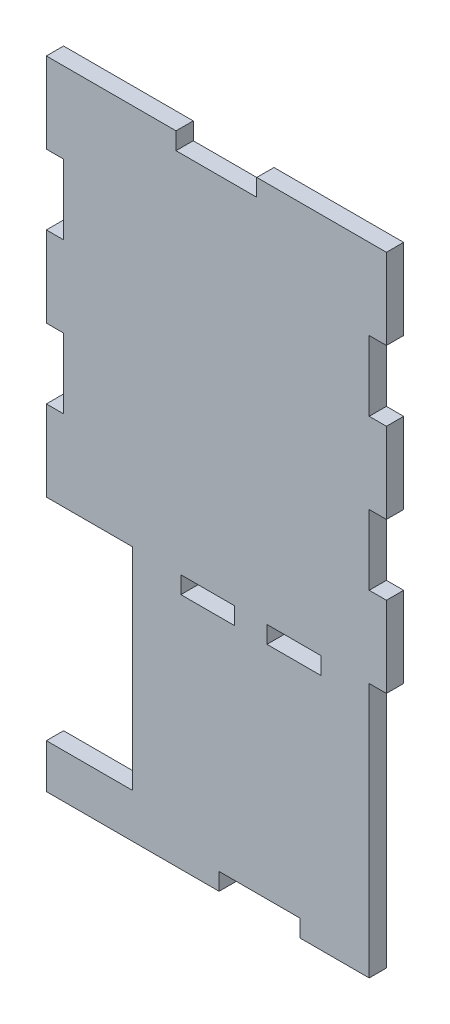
ISO-10303-21;
HEADER;
FILE_DESCRIPTION(('STEP AP214'),'2;1');
FILE_NAME('part.step','',(''),(''),'','','');
FILE_SCHEMA(('AUTOMOTIVE_DESIGN { 1 0 10303 214 1 1 1 1 }'));
ENDSEC;
DATA;
#1=APPLICATION_CONTEXT('core data for automotive mechanical design processes');
#2=APPLICATION_PROTOCOL_DEFINITION('international standard','automotive_design',2000,#1);
#3=PRODUCT_CONTEXT('',#1,'mechanical');
#4=PRODUCT('Part','Part','',(#3));
#5=PRODUCT_RELATED_PRODUCT_CATEGORY('part','',(#4));
#6=PRODUCT_DEFINITION_FORMATION('','',#4);
#7=PRODUCT_DEFINITION_CONTEXT('part definition',#1,'design');
#8=PRODUCT_DEFINITION('design','',#6,#7);
#9=PRODUCT_DEFINITION_SHAPE('','',#8);
#10=(LENGTH_UNIT() NAMED_UNIT(*) SI_UNIT(.MILLI.,.METRE.));
#11=(NAMED_UNIT(*) PLANE_ANGLE_UNIT() SI_UNIT($,.RADIAN.));
#12=(NAMED_UNIT(*) SI_UNIT($,.STERADIAN.) SOLID_ANGLE_UNIT());
#13=UNCERTAINTY_MEASURE_WITH_UNIT(LENGTH_MEASURE(1.E-05),#10,'distance_accuracy_value','');
#14=(GEOMETRIC_REPRESENTATION_CONTEXT(3) GLOBAL_UNCERTAINTY_ASSIGNED_CONTEXT((#13)) GLOBAL_UNIT_ASSIGNED_CONTEXT((#10,
#11,#12)) REPRESENTATION_CONTEXT('',''));
#15=CARTESIAN_POINT('',(0.,0.,0.));
#16=DIRECTION('',(0.,0.,1.));
#17=DIRECTION('',(1.,0.,0.));
#18=AXIS2_PLACEMENT_3D('',#15,#16,#17);
#19=CARTESIAN_POINT('',(0.,535.,16.));
#20=DIRECTION('',(0.,-1.,0.));
#21=DIRECTION('',(0.,0.,-1.));
#22=AXIS2_PLACEMENT_3D('',#19,#20,#21);
#23=PLANE('',#22);
#24=DIRECTION('',(-1.,0.,0.));
#25=VECTOR('',#24,1.);
#26=CARTESIAN_POINT('',(0.,535.,0.));
#27=LINE('',#26,#25);
#28=CARTESIAN_POINT('',(220.,535.,0.));
#29=VERTEX_POINT('',#28);
#30=CARTESIAN_POINT('',(99.5,535.,0.));
#31=VERTEX_POINT('',#30);
#32=EDGE_CURVE('E562',#29,#31,#27,.T.);
#33=ORIENTED_EDGE('',*,*,#32,.T.);
#34=DIRECTION('',(0.,0.,-1.));
#35=VECTOR('',#34,1.);
#36=CARTESIAN_POINT('',(99.5,535.,16.));
#37=LINE('',#36,#35);
#38=CARTESIAN_POINT('',(99.5,535.,16.));
#39=VERTEX_POINT('',#38);
#40=EDGE_CURVE('E12',#39,#31,#37,.T.);
#41=ORIENTED_EDGE('',*,*,#40,.F.);
#42=DIRECTION('',(-1.,0.,0.));
#43=VECTOR('',#42,1.);
#44=CARTESIAN_POINT('',(0.,535.,16.));
#45=LINE('',#44,#43);
#46=CARTESIAN_POINT('',(220.,535.,16.));
#47=VERTEX_POINT('',#46);
#48=EDGE_CURVE('E467',#47,#39,#45,.T.);
#49=ORIENTED_EDGE('',*,*,#48,.F.);
#50=DIRECTION('',(0.,0.,-1.));
#51=VECTOR('',#50,1.);
#52=CARTESIAN_POINT('',(220.,535.,16.));
#53=LINE('',#52,#51);
#54=EDGE_CURVE('E653',#47,#29,#53,.T.);
#55=ORIENTED_EDGE('',*,*,#54,.T.);
#56=EDGE_LOOP('',(#33,#41,#49,#55));
#57=FACE_BOUND('',#56,.T.);
#58=ADVANCED_FACE('F150',(#57),#23,.F.);
#59=CARTESIAN_POINT('',(99.5,0.,16.));
#60=DIRECTION('',(1.,0.,0.));
#61=DIRECTION('',(0.,0.,-1.));
#62=AXIS2_PLACEMENT_3D('',#59,#60,#61);
#63=PLANE('',#62);
#64=DIRECTION('',(0.,-1.,0.));
#65=VECTOR('',#64,1.);
#66=CARTESIAN_POINT('',(99.5,0.,0.));
#67=LINE('',#66,#65);
#68=CARTESIAN_POINT('',(99.5,519.,0.));
#69=VERTEX_POINT('',#68);
#70=EDGE_CURVE('E565',#31,#69,#67,.T.);
#71=ORIENTED_EDGE('',*,*,#70,.T.);
#72=DIRECTION('',(0.,0.,-1.));
#73=VECTOR('',#72,1.);
#74=CARTESIAN_POINT('',(99.5,519.,16.));
#75=LINE('',#74,#73);
#76=CARTESIAN_POINT('',(99.5,519.,16.));
#77=VERTEX_POINT('',#76);
#78=EDGE_CURVE('E159',#77,#69,#75,.T.);
#79=ORIENTED_EDGE('',*,*,#78,.F.);
#80=DIRECTION('',(0.,-1.,0.));
#81=VECTOR('',#80,1.);
#82=CARTESIAN_POINT('',(99.5,0.,16.));
#83=LINE('',#82,#81);
#84=EDGE_CURVE('E470',#39,#77,#83,.T.);
#85=ORIENTED_EDGE('',*,*,#84,.F.);
#86=ORIENTED_EDGE('',*,*,#40,.T.);
#87=EDGE_LOOP('',(#71,#79,#85,#86));
#88=FACE_BOUND('',#87,.T.);
#89=ADVANCED_FACE('F759',(#88),#63,.F.);
#90=CARTESIAN_POINT('',(0.,519.,16.));
#91=DIRECTION('',(0.,1.,0.));
#92=DIRECTION('',(0.,0.,1.));
#93=AXIS2_PLACEMENT_3D('',#90,#91,#92);
#94=PLANE('',#93);
#95=DIRECTION('',(1.,0.,0.));
#96=VECTOR('',#95,1.);
#97=CARTESIAN_POINT('',(0.,519.,0.));
#98=LINE('',#97,#96);
#99=CARTESIAN_POINT('',(24.5,519.,0.));
#100=VERTEX_POINT('',#99);
#101=EDGE_CURVE('E568',#100,#69,#98,.T.);
#102=ORIENTED_EDGE('',*,*,#101,.F.);
#103=DIRECTION('',(0.,0.,-1.));
#104=VECTOR('',#103,1.);
#105=CARTESIAN_POINT('',(24.5,519.,16.));
#106=LINE('',#105,#104);
#107=CARTESIAN_POINT('',(24.5,519.,16.));
#108=VERTEX_POINT('',#107);
#109=EDGE_CURVE('E723',#108,#100,#106,.T.);
#110=ORIENTED_EDGE('',*,*,#109,.F.);
#111=DIRECTION('',(1.,0.,0.));
#112=VECTOR('',#111,1.);
#113=CARTESIAN_POINT('',(0.,519.,16.));
#114=LINE('',#113,#112);
#115=EDGE_CURVE('E472',#108,#77,#114,.T.);
#116=ORIENTED_EDGE('',*,*,#115,.T.);
#117=ORIENTED_EDGE('',*,*,#78,.T.);
#118=EDGE_LOOP('',(#102,#110,#116,#117));
#119=FACE_BOUND('',#118,.T.);
#120=ADVANCED_FACE('F765',(#119),#94,.T.);
#121=CARTESIAN_POINT('',(24.5000000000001,0.,16.));
#122=DIRECTION('',(1.,0.,0.));
#123=DIRECTION('',(0.,1.,0.));
#124=AXIS2_PLACEMENT_3D('',#121,#122,#123);
#125=PLANE('',#124);
#126=DIRECTION('',(0.,-1.,0.));
#127=VECTOR('',#126,1.);
#128=CARTESIAN_POINT('',(24.5000000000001,0.,0.));
#129=LINE('',#128,#127);
#130=CARTESIAN_POINT('',(24.5,535.,0.));
#131=VERTEX_POINT('',#130);
#132=EDGE_CURVE('E571',#131,#100,#129,.T.);
#133=ORIENTED_EDGE('',*,*,#132,.F.);
#134=DIRECTION('',(0.,0.,-1.));
#135=VECTOR('',#134,1.);
#136=CARTESIAN_POINT('',(24.5,535.,16.));
#137=LINE('',#136,#135);
#138=CARTESIAN_POINT('',(24.5,535.,16.));
#139=VERTEX_POINT('',#138);
#140=EDGE_CURVE('E721',#139,#131,#137,.T.);
#141=ORIENTED_EDGE('',*,*,#140,.F.);
#142=DIRECTION('',(0.,-1.,0.));
#143=VECTOR('',#142,1.);
#144=CARTESIAN_POINT('',(24.5000000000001,0.,16.));
#145=LINE('',#144,#143);
#146=EDGE_CURVE('E475',#139,#108,#145,.T.);
#147=ORIENTED_EDGE('',*,*,#146,.T.);
#148=ORIENTED_EDGE('',*,*,#109,.T.);
#149=EDGE_LOOP('',(#133,#141,#147,#148));
#150=FACE_BOUND('',#149,.T.);
#151=ADVANCED_FACE('F771',(#150),#125,.T.);
#152=CARTESIAN_POINT('',(0.,535.,16.));
#153=DIRECTION('',(0.,-1.,0.));
#154=DIRECTION('',(0.,0.,-1.));
#155=AXIS2_PLACEMENT_3D('',#152,#153,#154);
#156=PLANE('',#155);
#157=DIRECTION('',(-1.,0.,0.));
#158=VECTOR('',#157,1.);
#159=CARTESIAN_POINT('',(0.,535.,0.));
#160=LINE('',#159,#158);
#161=CARTESIAN_POINT('',(-96.,535.,0.));
#162=VERTEX_POINT('',#161);
#163=EDGE_CURVE('E574',#131,#162,#160,.T.);
#164=ORIENTED_EDGE('',*,*,#163,.T.);
#165=DIRECTION('',(0.,0.,-1.));
#166=VECTOR('',#165,1.);
#167=CARTESIAN_POINT('',(-96.,535.,16.));
#168=LINE('',#167,#166);
#169=CARTESIAN_POINT('',(-96.,535.,16.));
#170=VERTEX_POINT('',#169);
#171=EDGE_CURVE('E719',#170,#162,#168,.T.);
#172=ORIENTED_EDGE('',*,*,#171,.F.);
#173=DIRECTION('',(-1.,0.,0.));
#174=VECTOR('',#173,1.);
#175=CARTESIAN_POINT('',(0.,535.,16.));
#176=LINE('',#175,#174);
#177=EDGE_CURVE('E478',#139,#170,#176,.T.);
#178=ORIENTED_EDGE('',*,*,#177,.F.);
#179=ORIENTED_EDGE('',*,*,#140,.T.);
#180=EDGE_LOOP('',(#164,#172,#178,#179));
#181=FACE_BOUND('',#180,.T.);
#182=ADVANCED_FACE('F775',(#181),#156,.F.);
#183=CARTESIAN_POINT('',(-96.,0.,16.));
#184=DIRECTION('',(-1.,0.,0.));
#185=DIRECTION('',(0.,0.,1.));
#186=AXIS2_PLACEMENT_3D('',#183,#184,#185);
#187=PLANE('',#186);
#188=DIRECTION('',(0.,1.,0.));
#189=VECTOR('',#188,1.);
#190=CARTESIAN_POINT('',(-96.,0.,0.));
#191=LINE('',#190,#189);
#192=CARTESIAN_POINT('',(-96.,460.,0.));
#193=VERTEX_POINT('',#192);
#194=EDGE_CURVE('E577',#193,#162,#191,.T.);
#195=ORIENTED_EDGE('',*,*,#194,.F.);
#196=DIRECTION('',(0.,0.,-1.));
#197=VECTOR('',#196,1.);
#198=CARTESIAN_POINT('',(-96.,460.,16.));
#199=LINE('',#198,#197);
#200=CARTESIAN_POINT('',(-96.,460.,16.));
#201=VERTEX_POINT('',#200);
#202=EDGE_CURVE('E717',#201,#193,#199,.T.);
#203=ORIENTED_EDGE('',*,*,#202,.F.);
#204=DIRECTION('',(0.,1.,0.));
#205=VECTOR('',#204,1.);
#206=CARTESIAN_POINT('',(-96.,0.,16.));
#207=LINE('',#206,#205);
#208=EDGE_CURVE('E480',#201,#170,#207,.T.);
#209=ORIENTED_EDGE('',*,*,#208,.T.);
#210=ORIENTED_EDGE('',*,*,#171,.T.);
#211=EDGE_LOOP('',(#195,#203,#209,#210));
#212=FACE_BOUND('',#211,.T.);
#213=ADVANCED_FACE('F779',(#212),#187,.T.);
#214=CARTESIAN_POINT('',(0.,460.,16.));
#215=DIRECTION('',(0.,1.,0.));
#216=DIRECTION('',(0.,0.,1.));
#217=AXIS2_PLACEMENT_3D('',#214,#215,#216);
#218=PLANE('',#217);
#219=DIRECTION('',(1.,0.,0.));
#220=VECTOR('',#219,1.);
#221=CARTESIAN_POINT('',(0.,460.,0.));
#222=LINE('',#221,#220);
#223=CARTESIAN_POINT('',(-80.,460.,0.));
#224=VERTEX_POINT('',#223);
#225=EDGE_CURVE('E580',#193,#224,#222,.T.);
#226=ORIENTED_EDGE('',*,*,#225,.T.);
#227=DIRECTION('',(0.,0.,-1.));
#228=VECTOR('',#227,1.);
#229=CARTESIAN_POINT('',(-80.,460.,16.));
#230=LINE('',#229,#228);
#231=CARTESIAN_POINT('',(-80.,460.,16.));
#232=VERTEX_POINT('',#231);
#233=EDGE_CURVE('E714',#232,#224,#230,.T.);
#234=ORIENTED_EDGE('',*,*,#233,.F.);
#235=DIRECTION('',(1.,0.,0.));
#236=VECTOR('',#235,1.);
#237=CARTESIAN_POINT('',(0.,460.,16.));
#238=LINE('',#237,#236);
#239=EDGE_CURVE('E483',#201,#232,#238,.T.);
#240=ORIENTED_EDGE('',*,*,#239,.F.);
#241=ORIENTED_EDGE('',*,*,#202,.T.);
#242=EDGE_LOOP('',(#226,#234,#240,#241));
#243=FACE_BOUND('',#242,.T.);
#244=ADVANCED_FACE('F783',(#243),#218,.F.);
#245=CARTESIAN_POINT('',(-80.,0.,16.));
#246=DIRECTION('',(1.,0.,0.));
#247=DIRECTION('',(0.,0.,-1.));
#248=AXIS2_PLACEMENT_3D('',#245,#246,#247);
#249=PLANE('',#248);
#250=DIRECTION('',(0.,-1.,0.));
#251=VECTOR('',#250,1.);
#252=CARTESIAN_POINT('',(-80.,0.,0.));
#253=LINE('',#252,#251);
#254=CARTESIAN_POINT('',(-80.,395.,0.));
#255=VERTEX_POINT('',#254);
#256=EDGE_CURVE('E582',#224,#255,#253,.T.);
#257=ORIENTED_EDGE('',*,*,#256,.T.);
#258=DIRECTION('',(0.,0.,-1.));
#259=VECTOR('',#258,1.);
#260=CARTESIAN_POINT('',(-80.,395.,16.));
#261=LINE('',#260,#259);
#262=CARTESIAN_POINT('',(-80.,395.,16.));
#263=VERTEX_POINT('',#262);
#264=EDGE_CURVE('E712',#263,#255,#261,.T.);
#265=ORIENTED_EDGE('',*,*,#264,.F.);
#266=DIRECTION('',(0.,-1.,0.));
#267=VECTOR('',#266,1.);
#268=CARTESIAN_POINT('',(-80.,0.,16.));
#269=LINE('',#268,#267);
#270=EDGE_CURVE('E485',#232,#263,#269,.T.);
#271=ORIENTED_EDGE('',*,*,#270,.F.);
#272=ORIENTED_EDGE('',*,*,#233,.T.);
#273=EDGE_LOOP('',(#257,#265,#271,#272));
#274=FACE_BOUND('',#273,.T.);
#275=ADVANCED_FACE('F787',(#274),#249,.F.);
#276=CARTESIAN_POINT('',(0.,395.,16.));
#277=DIRECTION('',(0.,1.,0.));
#278=DIRECTION('',(0.,0.,1.));
#279=AXIS2_PLACEMENT_3D('',#276,#277,#278);
#280=PLANE('',#279);
#281=DIRECTION('',(1.,0.,0.));
#282=VECTOR('',#281,1.);
#283=CARTESIAN_POINT('',(0.,395.,0.));
#284=LINE('',#283,#282);
#285=CARTESIAN_POINT('',(-96.,395.,0.));
#286=VERTEX_POINT('',#285);
#287=EDGE_CURVE('E585',#286,#255,#284,.T.);
#288=ORIENTED_EDGE('',*,*,#287,.F.);
#289=DIRECTION('',(0.,0.,-1.));
#290=VECTOR('',#289,1.);
#291=CARTESIAN_POINT('',(-96.,395.,16.));
#292=LINE('',#291,#290);
#293=CARTESIAN_POINT('',(-96.,395.,16.));
#294=VERTEX_POINT('',#293);
#295=EDGE_CURVE('E710',#294,#286,#292,.T.);
#296=ORIENTED_EDGE('',*,*,#295,.F.);
#297=DIRECTION('',(1.,0.,0.));
#298=VECTOR('',#297,1.);
#299=CARTESIAN_POINT('',(0.,395.,16.));
#300=LINE('',#299,#298);
#301=EDGE_CURVE('E487',#294,#263,#300,.T.);
#302=ORIENTED_EDGE('',*,*,#301,.T.);
#303=ORIENTED_EDGE('',*,*,#264,.T.);
#304=EDGE_LOOP('',(#288,#296,#302,#303));
#305=FACE_BOUND('',#304,.T.);
#306=ADVANCED_FACE('F791',(#305),#280,.T.);
#307=CARTESIAN_POINT('',(-96.,0.,16.));
#308=DIRECTION('',(-1.,0.,0.));
#309=DIRECTION('',(0.,0.,1.));
#310=AXIS2_PLACEMENT_3D('',#307,#308,#309);
#311=PLANE('',#310);
#312=DIRECTION('',(0.,1.,0.));
#313=VECTOR('',#312,1.);
#314=CARTESIAN_POINT('',(-96.,0.,0.));
#315=LINE('',#314,#313);
#316=CARTESIAN_POINT('',(-96.,320.,0.));
#317=VERTEX_POINT('',#316);
#318=EDGE_CURVE('E588',#317,#286,#315,.T.);
#319=ORIENTED_EDGE('',*,*,#318,.F.);
#320=DIRECTION('',(0.,0.,-1.));
#321=VECTOR('',#320,1.);
#322=CARTESIAN_POINT('',(-96.,320.,16.));
#323=LINE('',#322,#321);
#324=CARTESIAN_POINT('',(-96.,320.,16.));
#325=VERTEX_POINT('',#324);
#326=EDGE_CURVE('E708',#325,#317,#323,.T.);
#327=ORIENTED_EDGE('',*,*,#326,.F.);
#328=DIRECTION('',(0.,1.,0.));
#329=VECTOR('',#328,1.);
#330=CARTESIAN_POINT('',(-96.,0.,16.));
#331=LINE('',#330,#329);
#332=EDGE_CURVE('E490',#325,#294,#331,.T.);
#333=ORIENTED_EDGE('',*,*,#332,.T.);
#334=ORIENTED_EDGE('',*,*,#295,.T.);
#335=EDGE_LOOP('',(#319,#327,#333,#334));
#336=FACE_BOUND('',#335,.T.);
#337=ADVANCED_FACE('F795',(#336),#311,.T.);
#338=CARTESIAN_POINT('',(0.,320.,16.));
#339=DIRECTION('',(0.,1.,0.));
#340=DIRECTION('',(0.,0.,1.));
#341=AXIS2_PLACEMENT_3D('',#338,#339,#340);
#342=PLANE('',#341);
#343=DIRECTION('',(1.,0.,0.));
#344=VECTOR('',#343,1.);
#345=CARTESIAN_POINT('',(0.,320.,0.));
#346=LINE('',#345,#344);
#347=CARTESIAN_POINT('',(-80.,320.,0.));
#348=VERTEX_POINT('',#347);
#349=EDGE_CURVE('E591',#317,#348,#346,.T.);
#350=ORIENTED_EDGE('',*,*,#349,.T.);
#351=DIRECTION('',(0.,0.,-1.));
#352=VECTOR('',#351,1.);
#353=CARTESIAN_POINT('',(-80.,320.,16.));
#354=LINE('',#353,#352);
#355=CARTESIAN_POINT('',(-80.,320.,16.));
#356=VERTEX_POINT('',#355);
#357=EDGE_CURVE('E705',#356,#348,#354,.T.);
#358=ORIENTED_EDGE('',*,*,#357,.F.);
#359=DIRECTION('',(1.,0.,0.));
#360=VECTOR('',#359,1.);
#361=CARTESIAN_POINT('',(0.,320.,16.));
#362=LINE('',#361,#360);
#363=EDGE_CURVE('E493',#325,#356,#362,.T.);
#364=ORIENTED_EDGE('',*,*,#363,.F.);
#365=ORIENTED_EDGE('',*,*,#326,.T.);
#366=EDGE_LOOP('',(#350,#358,#364,#365));
#367=FACE_BOUND('',#366,.T.);
#368=ADVANCED_FACE('F799',(#367),#342,.F.);
#369=CARTESIAN_POINT('',(-80.0000000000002,0.,16.));
#370=DIRECTION('',(1.,0.,0.));
#371=DIRECTION('',(0.,1.,0.));
#372=AXIS2_PLACEMENT_3D('',#369,#370,#371);
#373=PLANE('',#372);
#374=DIRECTION('',(0.,-1.,0.));
#375=VECTOR('',#374,1.);
#376=CARTESIAN_POINT('',(-80.0000000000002,0.,0.));
#377=LINE('',#376,#375);
#378=CARTESIAN_POINT('',(-80.,255.,0.));
#379=VERTEX_POINT('',#378);
#380=EDGE_CURVE('E593',#348,#379,#377,.T.);
#381=ORIENTED_EDGE('',*,*,#380,.T.);
#382=DIRECTION('',(0.,0.,-1.));
#383=VECTOR('',#382,1.);
#384=CARTESIAN_POINT('',(-80.,255.,16.));
#385=LINE('',#384,#383);
#386=CARTESIAN_POINT('',(-80.,255.,16.));
#387=VERTEX_POINT('',#386);
#388=EDGE_CURVE('E703',#387,#379,#385,.T.);
#389=ORIENTED_EDGE('',*,*,#388,.F.);
#390=DIRECTION('',(0.,-1.,0.));
#391=VECTOR('',#390,1.);
#392=CARTESIAN_POINT('',(-80.0000000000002,0.,16.));
#393=LINE('',#392,#391);
#394=EDGE_CURVE('E495',#356,#387,#393,.T.);
#395=ORIENTED_EDGE('',*,*,#394,.F.);
#396=ORIENTED_EDGE('',*,*,#357,.T.);
#397=EDGE_LOOP('',(#381,#389,#395,#396));
#398=FACE_BOUND('',#397,.T.);
#399=ADVANCED_FACE('F803',(#398),#373,.F.);
#400=CARTESIAN_POINT('',(0.,255.,16.));
#401=DIRECTION('',(0.,1.,0.));
#402=DIRECTION('',(0.,0.,1.));
#403=AXIS2_PLACEMENT_3D('',#400,#401,#402);
#404=PLANE('',#403);
#405=DIRECTION('',(1.,0.,0.));
#406=VECTOR('',#405,1.);
#407=CARTESIAN_POINT('',(0.,255.,0.));
#408=LINE('',#407,#406);
#409=CARTESIAN_POINT('',(-96.,255.,0.));
#410=VERTEX_POINT('',#409);
#411=EDGE_CURVE('E596',#410,#379,#408,.T.);
#412=ORIENTED_EDGE('',*,*,#411,.F.);
#413=DIRECTION('',(0.,0.,-1.));
#414=VECTOR('',#413,1.);
#415=CARTESIAN_POINT('',(-96.,255.,16.));
#416=LINE('',#415,#414);
#417=CARTESIAN_POINT('',(-96.,255.,16.));
#418=VERTEX_POINT('',#417);
#419=EDGE_CURVE('E701',#418,#410,#416,.T.);
#420=ORIENTED_EDGE('',*,*,#419,.F.);
#421=DIRECTION('',(1.,0.,0.));
#422=VECTOR('',#421,1.);
#423=CARTESIAN_POINT('',(0.,255.,16.));
#424=LINE('',#423,#422);
#425=EDGE_CURVE('E497',#418,#387,#424,.T.);
#426=ORIENTED_EDGE('',*,*,#425,.T.);
#427=ORIENTED_EDGE('',*,*,#388,.T.);
#428=EDGE_LOOP('',(#412,#420,#426,#427));
#429=FACE_BOUND('',#428,.T.);
#430=ADVANCED_FACE('F807',(#429),#404,.T.);
#431=CARTESIAN_POINT('',(-96.,0.,16.));
#432=DIRECTION('',(-1.,0.,0.));
#433=DIRECTION('',(0.,0.,1.));
#434=AXIS2_PLACEMENT_3D('',#431,#432,#433);
#435=PLANE('',#434);
#436=DIRECTION('',(0.,1.,0.));
#437=VECTOR('',#436,1.);
#438=CARTESIAN_POINT('',(-96.,0.,0.));
#439=LINE('',#438,#437);
#440=CARTESIAN_POINT('',(-96.,180.,0.));
#441=VERTEX_POINT('',#440);
#442=EDGE_CURVE('E599',#441,#410,#439,.T.);
#443=ORIENTED_EDGE('',*,*,#442,.F.);
#444=DIRECTION('',(0.,0.,-1.));
#445=VECTOR('',#444,1.);
#446=CARTESIAN_POINT('',(-96.,180.,16.));
#447=LINE('',#446,#445);
#448=CARTESIAN_POINT('',(-96.,180.,16.));
#449=VERTEX_POINT('',#448);
#450=EDGE_CURVE('E699',#449,#441,#447,.T.);
#451=ORIENTED_EDGE('',*,*,#450,.F.);
#452=DIRECTION('',(0.,1.,0.));
#453=VECTOR('',#452,1.);
#454=CARTESIAN_POINT('',(-96.,0.,16.));
#455=LINE('',#454,#453);
#456=EDGE_CURVE('E500',#449,#418,#455,.T.);
#457=ORIENTED_EDGE('',*,*,#456,.T.);
#458=ORIENTED_EDGE('',*,*,#419,.T.);
#459=EDGE_LOOP('',(#443,#451,#457,#458));
#460=FACE_BOUND('',#459,.T.);
#461=ADVANCED_FACE('F811',(#460),#435,.T.);
#462=CARTESIAN_POINT('',(0.,180.,16.));
#463=DIRECTION('',(0.,1.,0.));
#464=DIRECTION('',(0.,0.,1.));
#465=AXIS2_PLACEMENT_3D('',#462,#463,#464);
#466=PLANE('',#465);
#467=DIRECTION('',(1.,0.,0.));
#468=VECTOR('',#467,1.);
#469=CARTESIAN_POINT('',(0.,180.,0.));
#470=LINE('',#469,#468);
#471=CARTESIAN_POINT('',(-15.9999999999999,180.,0.));
#472=VERTEX_POINT('',#471);
#473=EDGE_CURVE('E602',#441,#472,#470,.T.);
#474=ORIENTED_EDGE('',*,*,#473,.T.);
#475=DIRECTION('',(0.,0.,-1.));
#476=VECTOR('',#475,1.);
#477=CARTESIAN_POINT('',(-15.9999999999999,180.,16.));
#478=LINE('',#477,#476);
#479=CARTESIAN_POINT('',(-15.9999999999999,180.,16.));
#480=VERTEX_POINT('',#479);
#481=EDGE_CURVE('E696',#480,#472,#478,.T.);
#482=ORIENTED_EDGE('',*,*,#481,.F.);
#483=DIRECTION('',(1.,0.,0.));
#484=VECTOR('',#483,1.);
#485=CARTESIAN_POINT('',(0.,180.,16.));
#486=LINE('',#485,#484);
#487=EDGE_CURVE('E503',#449,#480,#486,.T.);
#488=ORIENTED_EDGE('',*,*,#487,.F.);
#489=ORIENTED_EDGE('',*,*,#450,.T.);
#490=EDGE_LOOP('',(#474,#482,#488,#489));
#491=FACE_BOUND('',#490,.T.);
#492=ADVANCED_FACE('F815',(#491),#466,.F.);
#493=CARTESIAN_POINT('',(-16.,0.,16.));
#494=DIRECTION('',(1.,0.,0.));
#495=DIRECTION('',(0.,1.,0.));
#496=AXIS2_PLACEMENT_3D('',#493,#494,#495);
#497=PLANE('',#496);
#498=DIRECTION('',(0.,-1.,0.));
#499=VECTOR('',#498,1.);
#500=CARTESIAN_POINT('',(-16.,0.,0.));
#501=LINE('',#500,#499);
#502=CARTESIAN_POINT('',(-16.,-16.,0.));
#503=VERTEX_POINT('',#502);
#504=EDGE_CURVE('E604',#472,#503,#501,.T.);
#505=ORIENTED_EDGE('',*,*,#504,.T.);
#506=DIRECTION('',(0.,0.,-1.));
#507=VECTOR('',#506,1.);
#508=CARTESIAN_POINT('',(-16.,-16.,16.));
#509=LINE('',#508,#507);
#510=CARTESIAN_POINT('',(-16.,-16.,16.));
#511=VERTEX_POINT('',#510);
#512=EDGE_CURVE('E694',#511,#503,#509,.T.);
#513=ORIENTED_EDGE('',*,*,#512,.F.);
#514=DIRECTION('',(0.,-1.,0.));
#515=VECTOR('',#514,1.);
#516=CARTESIAN_POINT('',(-16.,0.,16.));
#517=LINE('',#516,#515);
#518=EDGE_CURVE('E505',#480,#511,#517,.T.);
#519=ORIENTED_EDGE('',*,*,#518,.F.);
#520=ORIENTED_EDGE('',*,*,#481,.T.);
#521=EDGE_LOOP('',(#505,#513,#519,#520));
#522=FACE_BOUND('',#521,.T.);
#523=ADVANCED_FACE('F819',(#522),#497,.F.);
#524=CARTESIAN_POINT('',(0.,-16.,16.));
#525=DIRECTION('',(0.,1.,0.));
#526=DIRECTION('',(-1.,0.,0.));
#527=AXIS2_PLACEMENT_3D('',#524,#525,#526);
#528=PLANE('',#527);
#529=DIRECTION('',(1.,0.,0.));
#530=VECTOR('',#529,1.);
#531=CARTESIAN_POINT('',(0.,-16.,0.));
#532=LINE('',#531,#530);
#533=CARTESIAN_POINT('',(-96.,-16.,0.));
#534=VERTEX_POINT('',#533);
#535=EDGE_CURVE('E607',#534,#503,#532,.T.);
#536=ORIENTED_EDGE('',*,*,#535,.F.);
#537=DIRECTION('',(0.,0.,-1.));
#538=VECTOR('',#537,1.);
#539=CARTESIAN_POINT('',(-96.,-16.,16.));
#540=LINE('',#539,#538);
#541=CARTESIAN_POINT('',(-96.,-16.,16.));
#542=VERTEX_POINT('',#541);
#543=EDGE_CURVE('E692',#542,#534,#540,.T.);
#544=ORIENTED_EDGE('',*,*,#543,.F.);
#545=DIRECTION('',(1.,0.,0.));
#546=VECTOR('',#545,1.);
#547=CARTESIAN_POINT('',(0.,-16.,16.));
#548=LINE('',#547,#546);
#549=EDGE_CURVE('E507',#542,#511,#548,.T.);
#550=ORIENTED_EDGE('',*,*,#549,.T.);
#551=ORIENTED_EDGE('',*,*,#512,.T.);
#552=EDGE_LOOP('',(#536,#544,#550,#551));
#553=FACE_BOUND('',#552,.T.);
#554=ADVANCED_FACE('F823',(#553),#528,.T.);
#555=CARTESIAN_POINT('',(-96.,0.,16.));
#556=DIRECTION('',(-1.,0.,0.));
#557=DIRECTION('',(0.,0.,1.));
#558=AXIS2_PLACEMENT_3D('',#555,#556,#557);
#559=PLANE('',#558);
#560=DIRECTION('',(0.,1.,0.));
#561=VECTOR('',#560,1.);
#562=CARTESIAN_POINT('',(-96.,0.,0.));
#563=LINE('',#562,#561);
#564=CARTESIAN_POINT('',(-96.,-57.,0.));
#565=VERTEX_POINT('',#564);
#566=EDGE_CURVE('E610',#565,#534,#563,.T.);
#567=ORIENTED_EDGE('',*,*,#566,.F.);
#568=DIRECTION('',(0.,0.,-1.));
#569=VECTOR('',#568,1.);
#570=CARTESIAN_POINT('',(-96.,-57.,16.));
#571=LINE('',#570,#569);
#572=CARTESIAN_POINT('',(-96.,-57.,16.));
#573=VERTEX_POINT('',#572);
#574=EDGE_CURVE('E690',#573,#565,#571,.T.);
#575=ORIENTED_EDGE('',*,*,#574,.F.);
#576=DIRECTION('',(0.,1.,0.));
#577=VECTOR('',#576,1.);
#578=CARTESIAN_POINT('',(-96.,0.,16.));
#579=LINE('',#578,#577);
#580=EDGE_CURVE('E510',#573,#542,#579,.T.);
#581=ORIENTED_EDGE('',*,*,#580,.T.);
#582=ORIENTED_EDGE('',*,*,#543,.T.);
#583=EDGE_LOOP('',(#567,#575,#581,#582));
#584=FACE_BOUND('',#583,.T.);
#585=ADVANCED_FACE('F827',(#584),#559,.T.);
#586=CARTESIAN_POINT('',(0.,-57.,16.));
#587=DIRECTION('',(0.,1.,0.));
#588=DIRECTION('',(0.,0.,1.));
#589=AXIS2_PLACEMENT_3D('',#586,#587,#588);
#590=PLANE('',#589);
#591=DIRECTION('',(1.,0.,0.));
#592=VECTOR('',#591,1.);
#593=CARTESIAN_POINT('',(0.,-57.,0.));
#594=LINE('',#593,#592);
#595=CARTESIAN_POINT('',(64.5,-57.,0.));
#596=VERTEX_POINT('',#595);
#597=EDGE_CURVE('E613',#565,#596,#594,.T.);
#598=ORIENTED_EDGE('',*,*,#597,.T.);
#599=DIRECTION('',(0.,0.,-1.));
#600=VECTOR('',#599,1.);
#601=CARTESIAN_POINT('',(64.5,-57.,16.));
#602=LINE('',#601,#600);
#603=CARTESIAN_POINT('',(64.5,-57.,16.));
#604=VERTEX_POINT('',#603);
#605=EDGE_CURVE('E687',#604,#596,#602,.T.);
#606=ORIENTED_EDGE('',*,*,#605,.F.);
#607=DIRECTION('',(1.,0.,0.));
#608=VECTOR('',#607,1.);
#609=CARTESIAN_POINT('',(0.,-57.,16.));
#610=LINE('',#609,#608);
#611=EDGE_CURVE('E513',#573,#604,#610,.T.);
#612=ORIENTED_EDGE('',*,*,#611,.F.);
#613=ORIENTED_EDGE('',*,*,#574,.T.);
#614=EDGE_LOOP('',(#598,#606,#612,#613));
#615=FACE_BOUND('',#614,.T.);
#616=ADVANCED_FACE('F831',(#615),#590,.F.);
#617=CARTESIAN_POINT('',(64.5,0.,16.));
#618=DIRECTION('',(-1.,0.,0.));
#619=DIRECTION('',(0.,0.,1.));
#620=AXIS2_PLACEMENT_3D('',#617,#618,#619);
#621=PLANE('',#620);
#622=DIRECTION('',(0.,1.,0.));
#623=VECTOR('',#622,1.);
#624=CARTESIAN_POINT('',(64.5,0.,0.));
#625=LINE('',#624,#623);
#626=CARTESIAN_POINT('',(64.5,-41.,0.));
#627=VERTEX_POINT('',#626);
#628=EDGE_CURVE('E615',#596,#627,#625,.T.);
#629=ORIENTED_EDGE('',*,*,#628,.T.);
#630=DIRECTION('',(0.,0.,-1.));
#631=VECTOR('',#630,1.);
#632=CARTESIAN_POINT('',(64.5,-41.,16.));
#633=LINE('',#632,#631);
#634=CARTESIAN_POINT('',(64.5,-41.,16.));
#635=VERTEX_POINT('',#634);
#636=EDGE_CURVE('E684',#635,#627,#633,.T.);
#637=ORIENTED_EDGE('',*,*,#636,.F.);
#638=DIRECTION('',(0.,1.,0.));
#639=VECTOR('',#638,1.);
#640=CARTESIAN_POINT('',(64.5,0.,16.));
#641=LINE('',#640,#639);
#642=EDGE_CURVE('E515',#604,#635,#641,.T.);
#643=ORIENTED_EDGE('',*,*,#642,.F.);
#644=ORIENTED_EDGE('',*,*,#605,.T.);
#645=EDGE_LOOP('',(#629,#637,#643,#644));
#646=FACE_BOUND('',#645,.T.);
#647=ADVANCED_FACE('F833',(#646),#621,.F.);
#648=CARTESIAN_POINT('',(0.,-41.,16.));
#649=DIRECTION('',(0.,1.,0.));
#650=DIRECTION('',(0.,0.,1.));
#651=AXIS2_PLACEMENT_3D('',#648,#649,#650);
#652=PLANE('',#651);
#653=DIRECTION('',(1.,0.,0.));
#654=VECTOR('',#653,1.);
#655=CARTESIAN_POINT('',(0.,-41.,0.));
#656=LINE('',#655,#654);
#657=CARTESIAN_POINT('',(139.5,-41.,0.));
#658=VERTEX_POINT('',#657);
#659=EDGE_CURVE('E618',#627,#658,#656,.T.);
#660=ORIENTED_EDGE('',*,*,#659,.T.);
#661=DIRECTION('',(0.,0.,-1.));
#662=VECTOR('',#661,1.);
#663=CARTESIAN_POINT('',(139.5,-41.,16.));
#664=LINE('',#663,#662);
#665=CARTESIAN_POINT('',(139.5,-41.,16.));
#666=VERTEX_POINT('',#665);
#667=EDGE_CURVE('E682',#666,#658,#664,.T.);
#668=ORIENTED_EDGE('',*,*,#667,.F.);
#669=DIRECTION('',(1.,0.,0.));
#670=VECTOR('',#669,1.);
#671=CARTESIAN_POINT('',(0.,-41.,16.));
#672=LINE('',#671,#670);
#673=EDGE_CURVE('E518',#635,#666,#672,.T.);
#674=ORIENTED_EDGE('',*,*,#673,.F.);
#675=ORIENTED_EDGE('',*,*,#636,.T.);
#676=EDGE_LOOP('',(#660,#668,#674,#675));
#677=FACE_BOUND('',#676,.T.);
#678=ADVANCED_FACE('F836',(#677),#652,.F.);
#679=CARTESIAN_POINT('',(139.5,0.,16.));
#680=DIRECTION('',(-1.,0.,0.));
#681=DIRECTION('',(0.,0.,1.));
#682=AXIS2_PLACEMENT_3D('',#679,#680,#681);
#683=PLANE('',#682);
#684=DIRECTION('',(0.,1.,0.));
#685=VECTOR('',#684,1.);
#686=CARTESIAN_POINT('',(139.5,0.,0.));
#687=LINE('',#686,#685);
#688=CARTESIAN_POINT('',(139.5,-57.,0.));
#689=VERTEX_POINT('',#688);
#690=EDGE_CURVE('E621',#689,#658,#687,.T.);
#691=ORIENTED_EDGE('',*,*,#690,.F.);
#692=DIRECTION('',(0.,0.,-1.));
#693=VECTOR('',#692,1.);
#694=CARTESIAN_POINT('',(139.5,-57.,16.));
#695=LINE('',#694,#693);
#696=CARTESIAN_POINT('',(139.5,-57.,16.));
#697=VERTEX_POINT('',#696);
#698=EDGE_CURVE('E680',#697,#689,#695,.T.);
#699=ORIENTED_EDGE('',*,*,#698,.F.);
#700=DIRECTION('',(0.,1.,0.));
#701=VECTOR('',#700,1.);
#702=CARTESIAN_POINT('',(139.5,0.,16.));
#703=LINE('',#702,#701);
#704=EDGE_CURVE('E520',#697,#666,#703,.T.);
#705=ORIENTED_EDGE('',*,*,#704,.T.);
#706=ORIENTED_EDGE('',*,*,#667,.T.);
#707=EDGE_LOOP('',(#691,#699,#705,#706));
#708=FACE_BOUND('',#707,.T.);
#709=ADVANCED_FACE('F840',(#708),#683,.T.);
#710=CARTESIAN_POINT('',(204.,-57.,0.));
#711=VERTEX_POINT('',#710);
#712=EDGE_CURVE('E616',#689,#711,#594,.T.);
#713=ORIENTED_EDGE('',*,*,#712,.T.);
#714=DIRECTION('',(0.,0.,-1.));
#715=VECTOR('',#714,1.);
#716=CARTESIAN_POINT('',(204.,-57.,16.));
#717=LINE('',#716,#715);
#718=CARTESIAN_POINT('',(204.,-57.,16.));
#719=VERTEX_POINT('',#718);
#720=EDGE_CURVE('E678',#719,#711,#717,.T.);
#721=ORIENTED_EDGE('',*,*,#720,.F.);
#722=EDGE_CURVE('E516',#697,#719,#610,.T.);
#723=ORIENTED_EDGE('',*,*,#722,.F.);
#724=ORIENTED_EDGE('',*,*,#698,.T.);
#725=EDGE_LOOP('',(#713,#721,#723,#724));
#726=FACE_BOUND('',#725,.T.);
#727=ADVANCED_FACE('F844',(#726),#590,.F.);
#728=CARTESIAN_POINT('',(204.,0.,16.));
#729=DIRECTION('',(1.,0.,0.));
#730=DIRECTION('',(0.,0.,-1.));
#731=AXIS2_PLACEMENT_3D('',#728,#729,#730);
#732=PLANE('',#731);
#733=DIRECTION('',(0.,-1.,0.));
#734=VECTOR('',#733,1.);
#735=CARTESIAN_POINT('',(204.,0.,0.));
#736=LINE('',#735,#734);
#737=CARTESIAN_POINT('',(204.,180.,0.));
#738=VERTEX_POINT('',#737);
#739=EDGE_CURVE('E624',#738,#711,#736,.T.);
#740=ORIENTED_EDGE('',*,*,#739,.F.);
#741=DIRECTION('',(0.,0.,-1.));
#742=VECTOR('',#741,1.);
#743=CARTESIAN_POINT('',(204.,180.,16.));
#744=LINE('',#743,#742);
#745=CARTESIAN_POINT('',(204.,180.,16.));
#746=VERTEX_POINT('',#745);
#747=EDGE_CURVE('E676',#746,#738,#744,.T.);
#748=ORIENTED_EDGE('',*,*,#747,.F.);
#749=DIRECTION('',(0.,-1.,0.));
#750=VECTOR('',#749,1.);
#751=CARTESIAN_POINT('',(204.,0.,16.));
#752=LINE('',#751,#750);
#753=EDGE_CURVE('E523',#746,#719,#752,.T.);
#754=ORIENTED_EDGE('',*,*,#753,.T.);
#755=ORIENTED_EDGE('',*,*,#720,.T.);
#756=EDGE_LOOP('',(#740,#748,#754,#755));
#757=FACE_BOUND('',#756,.T.);
#758=ADVANCED_FACE('F848',(#757),#732,.T.);
#759=CARTESIAN_POINT('',(0.,180.,16.));
#760=DIRECTION('',(0.,-1.,0.));
#761=DIRECTION('',(0.,0.,-1.));
#762=AXIS2_PLACEMENT_3D('',#759,#760,#761);
#763=PLANE('',#762);
#764=DIRECTION('',(-1.,0.,0.));
#765=VECTOR('',#764,1.);
#766=CARTESIAN_POINT('',(0.,180.,0.));
#767=LINE('',#766,#765);
#768=CARTESIAN_POINT('',(220.,180.,0.));
#769=VERTEX_POINT('',#768);
#770=EDGE_CURVE('E627',#769,#738,#767,.T.);
#771=ORIENTED_EDGE('',*,*,#770,.F.);
#772=DIRECTION('',(0.,0.,-1.));
#773=VECTOR('',#772,1.);
#774=CARTESIAN_POINT('',(220.,180.,16.));
#775=LINE('',#774,#773);
#776=CARTESIAN_POINT('',(220.,180.,16.));
#777=VERTEX_POINT('',#776);
#778=EDGE_CURVE('E674',#777,#769,#775,.T.);
#779=ORIENTED_EDGE('',*,*,#778,.F.);
#780=DIRECTION('',(-1.,0.,0.));
#781=VECTOR('',#780,1.);
#782=CARTESIAN_POINT('',(0.,180.,16.));
#783=LINE('',#782,#781);
#784=EDGE_CURVE('E526',#777,#746,#783,.T.);
#785=ORIENTED_EDGE('',*,*,#784,.T.);
#786=ORIENTED_EDGE('',*,*,#747,.T.);
#787=EDGE_LOOP('',(#771,#779,#785,#786));
#788=FACE_BOUND('',#787,.T.);
#789=ADVANCED_FACE('F852',(#788),#763,.T.);
#790=CARTESIAN_POINT('',(220.,0.,16.));
#791=DIRECTION('',(-1.,0.,0.));
#792=DIRECTION('',(0.,0.,1.));
#793=AXIS2_PLACEMENT_3D('',#790,#791,#792);
#794=PLANE('',#793);
#795=DIRECTION('',(0.,1.,0.));
#796=VECTOR('',#795,1.);
#797=CARTESIAN_POINT('',(220.,0.,0.));
#798=LINE('',#797,#796);
#799=CARTESIAN_POINT('',(220.,255.,0.));
#800=VERTEX_POINT('',#799);
#801=EDGE_CURVE('E630',#769,#800,#798,.T.);
#802=ORIENTED_EDGE('',*,*,#801,.T.);
#803=DIRECTION('',(0.,0.,-1.));
#804=VECTOR('',#803,1.);
#805=CARTESIAN_POINT('',(220.,255.,16.));
#806=LINE('',#805,#804);
#807=CARTESIAN_POINT('',(220.,255.,16.));
#808=VERTEX_POINT('',#807);
#809=EDGE_CURVE('E671',#808,#800,#806,.T.);
#810=ORIENTED_EDGE('',*,*,#809,.F.);
#811=DIRECTION('',(0.,1.,0.));
#812=VECTOR('',#811,1.);
#813=CARTESIAN_POINT('',(220.,0.,16.));
#814=LINE('',#813,#812);
#815=EDGE_CURVE('E529',#777,#808,#814,.T.);
#816=ORIENTED_EDGE('',*,*,#815,.F.);
#817=ORIENTED_EDGE('',*,*,#778,.T.);
#818=EDGE_LOOP('',(#802,#810,#816,#817));
#819=FACE_BOUND('',#818,.T.);
#820=ADVANCED_FACE('F856',(#819),#794,.F.);
#821=CARTESIAN_POINT('',(0.,255.,16.));
#822=DIRECTION('',(0.,-1.,0.));
#823=DIRECTION('',(0.,0.,-1.));
#824=AXIS2_PLACEMENT_3D('',#821,#822,#823);
#825=PLANE('',#824);
#826=DIRECTION('',(-1.,0.,0.));
#827=VECTOR('',#826,1.);
#828=CARTESIAN_POINT('',(0.,255.,0.));
#829=LINE('',#828,#827);
#830=CARTESIAN_POINT('',(204.,255.,0.));
#831=VERTEX_POINT('',#830);
#832=EDGE_CURVE('E632',#800,#831,#829,.T.);
#833=ORIENTED_EDGE('',*,*,#832,.T.);
#834=DIRECTION('',(0.,0.,-1.));
#835=VECTOR('',#834,1.);
#836=CARTESIAN_POINT('',(204.,255.,16.));
#837=LINE('',#836,#835);
#838=CARTESIAN_POINT('',(204.,255.,16.));
#839=VERTEX_POINT('',#838);
#840=EDGE_CURVE('E669',#839,#831,#837,.T.);
#841=ORIENTED_EDGE('',*,*,#840,.F.);
#842=DIRECTION('',(-1.,0.,0.));
#843=VECTOR('',#842,1.);
#844=CARTESIAN_POINT('',(0.,255.,16.));
#845=LINE('',#844,#843);
#846=EDGE_CURVE('E531',#808,#839,#845,.T.);
#847=ORIENTED_EDGE('',*,*,#846,.F.);
#848=ORIENTED_EDGE('',*,*,#809,.T.);
#849=EDGE_LOOP('',(#833,#841,#847,#848));
#850=FACE_BOUND('',#849,.T.);
#851=ADVANCED_FACE('F860',(#850),#825,.F.);
#852=CARTESIAN_POINT('',(204.,0.,16.));
#853=DIRECTION('',(1.,0.,0.));
#854=DIRECTION('',(0.,1.,0.));
#855=AXIS2_PLACEMENT_3D('',#852,#853,#854);
#856=PLANE('',#855);
#857=DIRECTION('',(0.,-1.,0.));
#858=VECTOR('',#857,1.);
#859=CARTESIAN_POINT('',(204.,0.,0.));
#860=LINE('',#859,#858);
#861=CARTESIAN_POINT('',(204.,320.,0.));
#862=VERTEX_POINT('',#861);
#863=EDGE_CURVE('E635',#862,#831,#860,.T.);
#864=ORIENTED_EDGE('',*,*,#863,.F.);
#865=DIRECTION('',(0.,0.,-1.));
#866=VECTOR('',#865,1.);
#867=CARTESIAN_POINT('',(204.,320.,16.));
#868=LINE('',#867,#866);
#869=CARTESIAN_POINT('',(204.,320.,16.));
#870=VERTEX_POINT('',#869);
#871=EDGE_CURVE('E667',#870,#862,#868,.T.);
#872=ORIENTED_EDGE('',*,*,#871,.F.);
#873=DIRECTION('',(0.,-1.,0.));
#874=VECTOR('',#873,1.);
#875=CARTESIAN_POINT('',(204.,0.,16.));
#876=LINE('',#875,#874);
#877=EDGE_CURVE('E533',#870,#839,#876,.T.);
#878=ORIENTED_EDGE('',*,*,#877,.T.);
#879=ORIENTED_EDGE('',*,*,#840,.T.);
#880=EDGE_LOOP('',(#864,#872,#878,#879));
#881=FACE_BOUND('',#880,.T.);
#882=ADVANCED_FACE('F864',(#881),#856,.T.);
#883=CARTESIAN_POINT('',(0.,320.,16.));
#884=DIRECTION('',(0.,-1.,0.));
#885=DIRECTION('',(0.,0.,-1.));
#886=AXIS2_PLACEMENT_3D('',#883,#884,#885);
#887=PLANE('',#886);
#888=DIRECTION('',(-1.,0.,0.));
#889=VECTOR('',#888,1.);
#890=CARTESIAN_POINT('',(0.,320.,0.));
#891=LINE('',#890,#889);
#892=CARTESIAN_POINT('',(220.,320.,0.));
#893=VERTEX_POINT('',#892);
#894=EDGE_CURVE('E638',#893,#862,#891,.T.);
#895=ORIENTED_EDGE('',*,*,#894,.F.);
#896=DIRECTION('',(0.,0.,-1.));
#897=VECTOR('',#896,1.);
#898=CARTESIAN_POINT('',(220.,320.,16.));
#899=LINE('',#898,#897);
#900=CARTESIAN_POINT('',(220.,320.,16.));
#901=VERTEX_POINT('',#900);
#902=EDGE_CURVE('E665',#901,#893,#899,.T.);
#903=ORIENTED_EDGE('',*,*,#902,.F.);
#904=DIRECTION('',(-1.,0.,0.));
#905=VECTOR('',#904,1.);
#906=CARTESIAN_POINT('',(0.,320.,16.));
#907=LINE('',#906,#905);
#908=EDGE_CURVE('E536',#901,#870,#907,.T.);
#909=ORIENTED_EDGE('',*,*,#908,.T.);
#910=ORIENTED_EDGE('',*,*,#871,.T.);
#911=EDGE_LOOP('',(#895,#903,#909,#910));
#912=FACE_BOUND('',#911,.T.);
#913=ADVANCED_FACE('F868',(#912),#887,.T.);
#914=CARTESIAN_POINT('',(220.,0.,16.));
#915=DIRECTION('',(-1.,0.,0.));
#916=DIRECTION('',(0.,0.,1.));
#917=AXIS2_PLACEMENT_3D('',#914,#915,#916);
#918=PLANE('',#917);
#919=DIRECTION('',(0.,1.,0.));
#920=VECTOR('',#919,1.);
#921=CARTESIAN_POINT('',(220.,0.,0.));
#922=LINE('',#921,#920);
#923=CARTESIAN_POINT('',(220.,395.,0.));
#924=VERTEX_POINT('',#923);
#925=EDGE_CURVE('E641',#893,#924,#922,.T.);
#926=ORIENTED_EDGE('',*,*,#925,.T.);
#927=DIRECTION('',(0.,0.,-1.));
#928=VECTOR('',#927,1.);
#929=CARTESIAN_POINT('',(220.,395.,16.));
#930=LINE('',#929,#928);
#931=CARTESIAN_POINT('',(220.,395.,16.));
#932=VERTEX_POINT('',#931);
#933=EDGE_CURVE('E662',#932,#924,#930,.T.);
#934=ORIENTED_EDGE('',*,*,#933,.F.);
#935=DIRECTION('',(0.,1.,0.));
#936=VECTOR('',#935,1.);
#937=CARTESIAN_POINT('',(220.,0.,16.));
#938=LINE('',#937,#936);
#939=EDGE_CURVE('E539',#901,#932,#938,.T.);
#940=ORIENTED_EDGE('',*,*,#939,.F.);
#941=ORIENTED_EDGE('',*,*,#902,.T.);
#942=EDGE_LOOP('',(#926,#934,#940,#941));
#943=FACE_BOUND('',#942,.T.);
#944=ADVANCED_FACE('F872',(#943),#918,.F.);
#945=CARTESIAN_POINT('',(0.,395.,16.));
#946=DIRECTION('',(0.,-1.,0.));
#947=DIRECTION('',(0.,0.,-1.));
#948=AXIS2_PLACEMENT_3D('',#945,#946,#947);
#949=PLANE('',#948);
#950=DIRECTION('',(-1.,0.,0.));
#951=VECTOR('',#950,1.);
#952=CARTESIAN_POINT('',(0.,395.,0.));
#953=LINE('',#952,#951);
#954=CARTESIAN_POINT('',(204.,395.,0.));
#955=VERTEX_POINT('',#954);
#956=EDGE_CURVE('E643',#924,#955,#953,.T.);
#957=ORIENTED_EDGE('',*,*,#956,.T.);
#958=DIRECTION('',(0.,0.,-1.));
#959=VECTOR('',#958,1.);
#960=CARTESIAN_POINT('',(204.,395.,16.));
#961=LINE('',#960,#959);
#962=CARTESIAN_POINT('',(204.,395.,16.));
#963=VERTEX_POINT('',#962);
#964=EDGE_CURVE('E660',#963,#955,#961,.T.);
#965=ORIENTED_EDGE('',*,*,#964,.F.);
#966=DIRECTION('',(-1.,0.,0.));
#967=VECTOR('',#966,1.);
#968=CARTESIAN_POINT('',(0.,395.,16.));
#969=LINE('',#968,#967);
#970=EDGE_CURVE('E541',#932,#963,#969,.T.);
#971=ORIENTED_EDGE('',*,*,#970,.F.);
#972=ORIENTED_EDGE('',*,*,#933,.T.);
#973=EDGE_LOOP('',(#957,#965,#971,#972));
#974=FACE_BOUND('',#973,.T.);
#975=ADVANCED_FACE('F876',(#974),#949,.F.);
#976=CARTESIAN_POINT('',(204.,0.,16.));
#977=DIRECTION('',(1.,0.,0.));
#978=DIRECTION('',(0.,0.,-1.));
#979=AXIS2_PLACEMENT_3D('',#976,#977,#978);
#980=PLANE('',#979);
#981=DIRECTION('',(0.,-1.,0.));
#982=VECTOR('',#981,1.);
#983=CARTESIAN_POINT('',(204.,0.,0.));
#984=LINE('',#983,#982);
#985=CARTESIAN_POINT('',(204.,460.,0.));
#986=VERTEX_POINT('',#985);
#987=EDGE_CURVE('E646',#986,#955,#984,.T.);
#988=ORIENTED_EDGE('',*,*,#987,.F.);
#989=DIRECTION('',(0.,0.,-1.));
#990=VECTOR('',#989,1.);
#991=CARTESIAN_POINT('',(204.,460.,16.));
#992=LINE('',#991,#990);
#993=CARTESIAN_POINT('',(204.,460.,16.));
#994=VERTEX_POINT('',#993);
#995=EDGE_CURVE('E658',#994,#986,#992,.T.);
#996=ORIENTED_EDGE('',*,*,#995,.F.);
#997=DIRECTION('',(0.,-1.,0.));
#998=VECTOR('',#997,1.);
#999=CARTESIAN_POINT('',(204.,0.,16.));
#1000=LINE('',#999,#998);
#1001=EDGE_CURVE('E543',#994,#963,#1000,.T.);
#1002=ORIENTED_EDGE('',*,*,#1001,.T.);
#1003=ORIENTED_EDGE('',*,*,#964,.T.);
#1004=EDGE_LOOP('',(#988,#996,#1002,#1003));
#1005=FACE_BOUND('',#1004,.T.);
#1006=ADVANCED_FACE('F880',(#1005),#980,.T.);
#1007=CARTESIAN_POINT('',(0.,460.,16.));
#1008=DIRECTION('',(0.,-1.,0.));
#1009=DIRECTION('',(0.,0.,-1.));
#1010=AXIS2_PLACEMENT_3D('',#1007,#1008,#1009);
#1011=PLANE('',#1010);
#1012=DIRECTION('',(-1.,0.,0.));
#1013=VECTOR('',#1012,1.);
#1014=CARTESIAN_POINT('',(0.,460.,0.));
#1015=LINE('',#1014,#1013);
#1016=CARTESIAN_POINT('',(220.,460.,0.));
#1017=VERTEX_POINT('',#1016);
#1018=EDGE_CURVE('E649',#1017,#986,#1015,.T.);
#1019=ORIENTED_EDGE('',*,*,#1018,.F.);
#1020=DIRECTION('',(0.,0.,-1.));
#1021=VECTOR('',#1020,1.);
#1022=CARTESIAN_POINT('',(220.,460.,16.));
#1023=LINE('',#1022,#1021);
#1024=CARTESIAN_POINT('',(220.,460.,16.));
#1025=VERTEX_POINT('',#1024);
#1026=EDGE_CURVE('E656',#1025,#1017,#1023,.T.);
#1027=ORIENTED_EDGE('',*,*,#1026,.F.);
#1028=DIRECTION('',(-1.,0.,0.));
#1029=VECTOR('',#1028,1.);
#1030=CARTESIAN_POINT('',(0.,460.,16.));
#1031=LINE('',#1030,#1029);
#1032=EDGE_CURVE('E546',#1025,#994,#1031,.T.);
#1033=ORIENTED_EDGE('',*,*,#1032,.T.);
#1034=ORIENTED_EDGE('',*,*,#995,.T.);
#1035=EDGE_LOOP('',(#1019,#1027,#1033,#1034));
#1036=FACE_BOUND('',#1035,.T.);
#1037=ADVANCED_FACE('F884',(#1036),#1011,.T.);
#1038=CARTESIAN_POINT('',(0.,180.,16.));
#1039=DIRECTION('',(0.,-1.,0.));
#1040=DIRECTION('',(0.,0.,-1.));
#1041=AXIS2_PLACEMENT_3D('',#1038,#1039,#1040);
#1042=PLANE('',#1041);
#1043=DIRECTION('',(-1.,0.,0.));
#1044=VECTOR('',#1043,1.);
#1045=CARTESIAN_POINT('',(0.,180.,0.));
#1046=LINE('',#1045,#1044);
#1047=CARTESIAN_POINT('',(79.,180.,0.));
#1048=VERTEX_POINT('',#1047);
#1049=CARTESIAN_POINT('',(29.,180.,0.));
#1050=VERTEX_POINT('',#1049);
#1051=EDGE_CURVE('E452',#1048,#1050,#1046,.T.);
#1052=ORIENTED_EDGE('',*,*,#1051,.F.);
#1053=DIRECTION('',(0.,0.,-1.));
#1054=VECTOR('',#1053,1.);
#1055=CARTESIAN_POINT('',(79.,180.,16.));
#1056=LINE('',#1055,#1054);
#1057=CARTESIAN_POINT('',(79.,180.,16.));
#1058=VERTEX_POINT('',#1057);
#1059=EDGE_CURVE('E154',#1058,#1048,#1056,.T.);
#1060=ORIENTED_EDGE('',*,*,#1059,.F.);
#1061=DIRECTION('',(-1.,0.,0.));
#1062=VECTOR('',#1061,1.);
#1063=CARTESIAN_POINT('',(0.,180.,16.));
#1064=LINE('',#1063,#1062);
#1065=CARTESIAN_POINT('',(29.,180.,16.));
#1066=VERTEX_POINT('',#1065);
#1067=EDGE_CURVE('E456',#1058,#1066,#1064,.T.);
#1068=ORIENTED_EDGE('',*,*,#1067,.T.);
#1069=DIRECTION('',(0.,0.,-1.));
#1070=VECTOR('',#1069,1.);
#1071=CARTESIAN_POINT('',(29.,180.,16.));
#1072=LINE('',#1071,#1070);
#1073=EDGE_CURVE('E551',#1066,#1050,#1072,.T.);
#1074=ORIENTED_EDGE('',*,*,#1073,.T.);
#1075=EDGE_LOOP('',(#1052,#1060,#1068,#1074));
#1076=FACE_BOUND('',#1075,.T.);
#1077=ADVANCED_FACE('F152',(#1076),#1042,.T.);
#1078=CARTESIAN_POINT('',(79.,0.,16.));
#1079=DIRECTION('',(1.,0.,0.));
#1080=DIRECTION('',(0.,0.,-1.));
#1081=AXIS2_PLACEMENT_3D('',#1078,#1079,#1080);
#1082=PLANE('',#1081);
#1083=DIRECTION('',(0.,-1.,0.));
#1084=VECTOR('',#1083,1.);
#1085=CARTESIAN_POINT('',(79.,0.,0.));
#1086=LINE('',#1085,#1084);
#1087=CARTESIAN_POINT('',(79.,164.,0.));
#1088=VERTEX_POINT('',#1087);
#1089=EDGE_CURVE('E554',#1048,#1088,#1086,.T.);
#1090=ORIENTED_EDGE('',*,*,#1089,.T.);
#1091=DIRECTION('',(0.,0.,-1.));
#1092=VECTOR('',#1091,1.);
#1093=CARTESIAN_POINT('',(79.,164.,16.));
#1094=LINE('',#1093,#1092);
#1095=CARTESIAN_POINT('',(79.,164.,16.));
#1096=VERTEX_POINT('',#1095);
#1097=EDGE_CURVE('E728',#1096,#1088,#1094,.T.);
#1098=ORIENTED_EDGE('',*,*,#1097,.F.);
#1099=DIRECTION('',(0.,-1.,0.));
#1100=VECTOR('',#1099,1.);
#1101=CARTESIAN_POINT('',(79.,0.,16.));
#1102=LINE('',#1101,#1100);
#1103=EDGE_CURVE('E459',#1058,#1096,#1102,.T.);
#1104=ORIENTED_EDGE('',*,*,#1103,.F.);
#1105=ORIENTED_EDGE('',*,*,#1059,.T.);
#1106=EDGE_LOOP('',(#1090,#1098,#1104,#1105));
#1107=FACE_BOUND('',#1106,.T.);
#1108=ADVANCED_FACE('F737',(#1107),#1082,.F.);
#1109=CARTESIAN_POINT('',(0.,164.,16.));
#1110=DIRECTION('',(0.,-1.,0.));
#1111=DIRECTION('',(0.,0.,-1.));
#1112=AXIS2_PLACEMENT_3D('',#1109,#1110,#1111);
#1113=PLANE('',#1112);
#1114=DIRECTION('',(-1.,0.,0.));
#1115=VECTOR('',#1114,1.);
#1116=CARTESIAN_POINT('',(0.,164.,0.));
#1117=LINE('',#1116,#1115);
#1118=CARTESIAN_POINT('',(29.,164.,0.));
#1119=VERTEX_POINT('',#1118);
#1120=EDGE_CURVE('E556',#1088,#1119,#1117,.T.);
#1121=ORIENTED_EDGE('',*,*,#1120,.T.);
#1122=DIRECTION('',(0.,0.,-1.));
#1123=VECTOR('',#1122,1.);
#1124=CARTESIAN_POINT('',(29.,164.,16.));
#1125=LINE('',#1124,#1123);
#1126=CARTESIAN_POINT('',(29.,164.,16.));
#1127=VERTEX_POINT('',#1126);
#1128=EDGE_CURVE('E727',#1127,#1119,#1125,.T.);
#1129=ORIENTED_EDGE('',*,*,#1128,.F.);
#1130=DIRECTION('',(-1.,0.,0.));
#1131=VECTOR('',#1130,1.);
#1132=CARTESIAN_POINT('',(0.,164.,16.));
#1133=LINE('',#1132,#1131);
#1134=EDGE_CURVE('E462',#1096,#1127,#1133,.T.);
#1135=ORIENTED_EDGE('',*,*,#1134,.F.);
#1136=ORIENTED_EDGE('',*,*,#1097,.T.);
#1137=EDGE_LOOP('',(#1121,#1129,#1135,#1136));
#1138=FACE_BOUND('',#1137,.T.);
#1139=ADVANCED_FACE('F749',(#1138),#1113,.F.);
#1140=CARTESIAN_POINT('',(29.,0.,16.));
#1141=DIRECTION('',(1.,0.,0.));
#1142=DIRECTION('',(0.,0.,-1.));
#1143=AXIS2_PLACEMENT_3D('',#1140,#1141,#1142);
#1144=PLANE('',#1143);
#1145=DIRECTION('',(0.,-1.,0.));
#1146=VECTOR('',#1145,1.);
#1147=CARTESIAN_POINT('',(29.,0.,0.));
#1148=LINE('',#1147,#1146);
#1149=EDGE_CURVE('E559',#1050,#1119,#1148,.T.);
#1150=ORIENTED_EDGE('',*,*,#1149,.F.);
#1151=ORIENTED_EDGE('',*,*,#1073,.F.);
#1152=DIRECTION('',(0.,-1.,0.));
#1153=VECTOR('',#1152,1.);
#1154=CARTESIAN_POINT('',(29.,0.,16.));
#1155=LINE('',#1154,#1153);
#1156=EDGE_CURVE('E464',#1066,#1127,#1155,.T.);
#1157=ORIENTED_EDGE('',*,*,#1156,.T.);
#1158=ORIENTED_EDGE('',*,*,#1128,.T.);
#1159=EDGE_LOOP('',(#1150,#1151,#1157,#1158));
#1160=FACE_BOUND('',#1159,.T.);
#1161=ADVANCED_FACE('F747',(#1160),#1144,.T.);
#1162=CARTESIAN_POINT('',(220.,0.,16.));
#1163=DIRECTION('',(-1.,0.,0.));
#1164=DIRECTION('',(0.,0.,1.));
#1165=AXIS2_PLACEMENT_3D('',#1162,#1163,#1164);
#1166=PLANE('',#1165);
#1167=DIRECTION('',(0.,1.,0.));
#1168=VECTOR('',#1167,1.);
#1169=CARTESIAN_POINT('',(220.,0.,0.));
#1170=LINE('',#1169,#1168);
#1171=EDGE_CURVE('E460',#1017,#29,#1170,.T.);
#1172=ORIENTED_EDGE('',*,*,#1171,.T.);
#1173=ORIENTED_EDGE('',*,*,#54,.F.);
#1174=DIRECTION('',(0.,1.,0.));
#1175=VECTOR('',#1174,1.);
#1176=CARTESIAN_POINT('',(220.,0.,16.));
#1177=LINE('',#1176,#1175);
#1178=EDGE_CURVE('E549',#1025,#47,#1177,.T.);
#1179=ORIENTED_EDGE('',*,*,#1178,.F.);
#1180=ORIENTED_EDGE('',*,*,#1026,.T.);
#1181=EDGE_LOOP('',(#1172,#1173,#1179,#1180));
#1182=FACE_BOUND('',#1181,.T.);
#1183=ADVANCED_FACE('F756',(#1182),#1166,.F.);
#1184=CARTESIAN_POINT('',(0.,0.,16.));
#1185=DIRECTION('',(0.,0.,1.));
#1186=DIRECTION('',(1.,0.,0.));
#1187=AXIS2_PLACEMENT_3D('',#1184,#1185,#1186);
#1188=PLANE('',#1187);
#1189=DIRECTION('',(1.,0.,0.));
#1190=VECTOR('',#1189,1.);
#1191=CARTESIAN_POINT('',(109.,180.,16.));
#1192=LINE('',#1191,#1190);
#1193=CARTESIAN_POINT('',(109.,180.,16.));
#1194=VERTEX_POINT('',#1193);
#1195=CARTESIAN_POINT('',(159.,180.,16.));
#1196=VERTEX_POINT('',#1195);
#1197=EDGE_CURVE('E423',#1194,#1196,#1192,.T.);
#1198=ORIENTED_EDGE('',*,*,#1197,.T.);
#1199=DIRECTION('',(0.,-1.,0.));
#1200=VECTOR('',#1199,1.);
#1201=CARTESIAN_POINT('',(159.,180.,16.));
#1202=LINE('',#1201,#1200);
#1203=CARTESIAN_POINT('',(159.,164.,16.));
#1204=VERTEX_POINT('',#1203);
#1205=EDGE_CURVE('E429',#1196,#1204,#1202,.T.);
#1206=ORIENTED_EDGE('',*,*,#1205,.T.);
#1207=DIRECTION('',(1.,0.,0.));
#1208=VECTOR('',#1207,1.);
#1209=CARTESIAN_POINT('',(109.,164.,16.));
#1210=LINE('',#1209,#1208);
#1211=CARTESIAN_POINT('',(109.,164.,16.));
#1212=VERTEX_POINT('',#1211);
#1213=EDGE_CURVE('E433',#1212,#1204,#1210,.T.);
#1214=ORIENTED_EDGE('',*,*,#1213,.F.);
#1215=DIRECTION('',(0.,-1.,0.));
#1216=VECTOR('',#1215,1.);
#1217=CARTESIAN_POINT('',(109.,180.,16.));
#1218=LINE('',#1217,#1216);
#1219=EDGE_CURVE('E426',#1194,#1212,#1218,.T.);
#1220=ORIENTED_EDGE('',*,*,#1219,.F.);
#1221=EDGE_LOOP('',(#1198,#1206,#1214,#1220));
#1222=FACE_BOUND('',#1221,.T.);
#1223=ORIENTED_EDGE('',*,*,#1067,.F.);
#1224=ORIENTED_EDGE('',*,*,#1103,.T.);
#1225=ORIENTED_EDGE('',*,*,#1134,.T.);
#1226=ORIENTED_EDGE('',*,*,#1156,.F.);
#1227=EDGE_LOOP('',(#1223,#1224,#1225,#1226));
#1228=FACE_BOUND('',#1227,.T.);
#1229=ORIENTED_EDGE('',*,*,#48,.T.);
#1230=ORIENTED_EDGE('',*,*,#84,.T.);
#1231=ORIENTED_EDGE('',*,*,#115,.F.);
#1232=ORIENTED_EDGE('',*,*,#146,.F.);
#1233=ORIENTED_EDGE('',*,*,#177,.T.);
#1234=ORIENTED_EDGE('',*,*,#208,.F.);
#1235=ORIENTED_EDGE('',*,*,#239,.T.);
#1236=ORIENTED_EDGE('',*,*,#270,.T.);
#1237=ORIENTED_EDGE('',*,*,#301,.F.);
#1238=ORIENTED_EDGE('',*,*,#332,.F.);
#1239=ORIENTED_EDGE('',*,*,#363,.T.);
#1240=ORIENTED_EDGE('',*,*,#394,.T.);
#1241=ORIENTED_EDGE('',*,*,#425,.F.);
#1242=ORIENTED_EDGE('',*,*,#456,.F.);
#1243=ORIENTED_EDGE('',*,*,#487,.T.);
#1244=ORIENTED_EDGE('',*,*,#518,.T.);
#1245=ORIENTED_EDGE('',*,*,#549,.F.);
#1246=ORIENTED_EDGE('',*,*,#580,.F.);
#1247=ORIENTED_EDGE('',*,*,#611,.T.);
#1248=ORIENTED_EDGE('',*,*,#642,.T.);
#1249=ORIENTED_EDGE('',*,*,#673,.T.);
#1250=ORIENTED_EDGE('',*,*,#704,.F.);
#1251=ORIENTED_EDGE('',*,*,#722,.T.);
#1252=ORIENTED_EDGE('',*,*,#753,.F.);
#1253=ORIENTED_EDGE('',*,*,#784,.F.);
#1254=ORIENTED_EDGE('',*,*,#815,.T.);
#1255=ORIENTED_EDGE('',*,*,#846,.T.);
#1256=ORIENTED_EDGE('',*,*,#877,.F.);
#1257=ORIENTED_EDGE('',*,*,#908,.F.);
#1258=ORIENTED_EDGE('',*,*,#939,.T.);
#1259=ORIENTED_EDGE('',*,*,#970,.T.);
#1260=ORIENTED_EDGE('',*,*,#1001,.F.);
#1261=ORIENTED_EDGE('',*,*,#1032,.F.);
#1262=ORIENTED_EDGE('',*,*,#1178,.T.);
#1263=EDGE_LOOP('',(#1229,#1230,#1231,#1232,#1233,#1234,#1235,#1236,#1237,#1238,#1239,#1240,
#1241,#1242,#1243,#1244,#1245,#1246,#1247,#1248,#1249,#1250,#1251,#1252,#1253,#1254,#1255,#1256,
#1257,#1258,#1259,#1260,#1261,#1262));
#1264=FACE_BOUND('',#1263,.T.);
#1265=ADVANCED_FACE('F435',(#1222,#1228,#1264),#1188,.T.);
#1266=CARTESIAN_POINT('',(0.,0.,0.));
#1267=DIRECTION('',(0.,0.,1.));
#1268=DIRECTION('',(1.,0.,0.));
#1269=AXIS2_PLACEMENT_3D('',#1266,#1267,#1268);
#1270=PLANE('',#1269);
#1271=DIRECTION('',(0.,-1.,0.));
#1272=VECTOR('',#1271,1.);
#1273=CARTESIAN_POINT('',(159.,180.,0.));
#1274=LINE('',#1273,#1272);
#1275=CARTESIAN_POINT('',(159.,180.,0.));
#1276=VERTEX_POINT('',#1275);
#1277=CARTESIAN_POINT('',(159.,164.,0.));
#1278=VERTEX_POINT('',#1277);
#1279=EDGE_CURVE('E446',#1276,#1278,#1274,.T.);
#1280=ORIENTED_EDGE('',*,*,#1279,.F.);
#1281=DIRECTION('',(1.,0.,0.));
#1282=VECTOR('',#1281,1.);
#1283=CARTESIAN_POINT('',(109.,180.,0.));
#1284=LINE('',#1283,#1282);
#1285=CARTESIAN_POINT('',(109.,180.,0.));
#1286=VERTEX_POINT('',#1285);
#1287=EDGE_CURVE('E175',#1286,#1276,#1284,.T.);
#1288=ORIENTED_EDGE('',*,*,#1287,.F.);
#1289=DIRECTION('',(0.,-1.,0.));
#1290=VECTOR('',#1289,1.);
#1291=CARTESIAN_POINT('',(109.,180.,0.));
#1292=LINE('',#1291,#1290);
#1293=CARTESIAN_POINT('',(109.,164.,0.));
#1294=VERTEX_POINT('',#1293);
#1295=EDGE_CURVE('E437',#1286,#1294,#1292,.T.);
#1296=ORIENTED_EDGE('',*,*,#1295,.T.);
#1297=DIRECTION('',(1.,0.,0.));
#1298=VECTOR('',#1297,1.);
#1299=CARTESIAN_POINT('',(109.,164.,0.));
#1300=LINE('',#1299,#1298);
#1301=EDGE_CURVE('E440',#1294,#1278,#1300,.T.);
#1302=ORIENTED_EDGE('',*,*,#1301,.T.);
#1303=EDGE_LOOP('',(#1280,#1288,#1296,#1302));
#1304=FACE_BOUND('',#1303,.T.);
#1305=ORIENTED_EDGE('',*,*,#1051,.T.);
#1306=ORIENTED_EDGE('',*,*,#1149,.T.);
#1307=ORIENTED_EDGE('',*,*,#1120,.F.);
#1308=ORIENTED_EDGE('',*,*,#1089,.F.);
#1309=EDGE_LOOP('',(#1305,#1306,#1307,#1308));
#1310=FACE_BOUND('',#1309,.T.);
#1311=ORIENTED_EDGE('',*,*,#32,.F.);
#1312=ORIENTED_EDGE('',*,*,#1171,.F.);
#1313=ORIENTED_EDGE('',*,*,#1018,.T.);
#1314=ORIENTED_EDGE('',*,*,#987,.T.);
#1315=ORIENTED_EDGE('',*,*,#956,.F.);
#1316=ORIENTED_EDGE('',*,*,#925,.F.);
#1317=ORIENTED_EDGE('',*,*,#894,.T.);
#1318=ORIENTED_EDGE('',*,*,#863,.T.);
#1319=ORIENTED_EDGE('',*,*,#832,.F.);
#1320=ORIENTED_EDGE('',*,*,#801,.F.);
#1321=ORIENTED_EDGE('',*,*,#770,.T.);
#1322=ORIENTED_EDGE('',*,*,#739,.T.);
#1323=ORIENTED_EDGE('',*,*,#712,.F.);
#1324=ORIENTED_EDGE('',*,*,#690,.T.);
#1325=ORIENTED_EDGE('',*,*,#659,.F.);
#1326=ORIENTED_EDGE('',*,*,#628,.F.);
#1327=ORIENTED_EDGE('',*,*,#597,.F.);
#1328=ORIENTED_EDGE('',*,*,#566,.T.);
#1329=ORIENTED_EDGE('',*,*,#535,.T.);
#1330=ORIENTED_EDGE('',*,*,#504,.F.);
#1331=ORIENTED_EDGE('',*,*,#473,.F.);
#1332=ORIENTED_EDGE('',*,*,#442,.T.);
#1333=ORIENTED_EDGE('',*,*,#411,.T.);
#1334=ORIENTED_EDGE('',*,*,#380,.F.);
#1335=ORIENTED_EDGE('',*,*,#349,.F.);
#1336=ORIENTED_EDGE('',*,*,#318,.T.);
#1337=ORIENTED_EDGE('',*,*,#287,.T.);
#1338=ORIENTED_EDGE('',*,*,#256,.F.);
#1339=ORIENTED_EDGE('',*,*,#225,.F.);
#1340=ORIENTED_EDGE('',*,*,#194,.T.);
#1341=ORIENTED_EDGE('',*,*,#163,.F.);
#1342=ORIENTED_EDGE('',*,*,#132,.T.);
#1343=ORIENTED_EDGE('',*,*,#101,.T.);
#1344=ORIENTED_EDGE('',*,*,#70,.F.);
#1345=EDGE_LOOP('',(#1311,#1312,#1313,#1314,#1315,#1316,#1317,#1318,#1319,#1320,#1321,#1322,
#1323,#1324,#1325,#1326,#1327,#1328,#1329,#1330,#1331,#1332,#1333,#1334,#1335,#1336,#1337,#1338,
#1339,#1340,#1341,#1342,#1343,#1344));
#1346=FACE_BOUND('',#1345,.T.);
#1347=ADVANCED_FACE('F742',(#1304,#1310,#1346),#1270,.F.);
#1348=CARTESIAN_POINT('',(109.,180.,16.));
#1349=DIRECTION('',(0.,1.,0.));
#1350=DIRECTION('',(0.,0.,1.));
#1351=AXIS2_PLACEMENT_3D('',#1348,#1349,#1350);
#1352=PLANE('',#1351);
#1353=ORIENTED_EDGE('',*,*,#1287,.T.);
#1354=DIRECTION('',(0.,0.,-1.));
#1355=VECTOR('',#1354,1.);
#1356=CARTESIAN_POINT('',(159.,180.,16.));
#1357=LINE('',#1356,#1355);
#1358=EDGE_CURVE('E420',#1196,#1276,#1357,.T.);
#1359=ORIENTED_EDGE('',*,*,#1358,.F.);
#1360=ORIENTED_EDGE('',*,*,#1197,.F.);
#1361=DIRECTION('',(0.,0.,-1.));
#1362=VECTOR('',#1361,1.);
#1363=CARTESIAN_POINT('',(109.,180.,16.));
#1364=LINE('',#1363,#1362);
#1365=EDGE_CURVE('E450',#1194,#1286,#1364,.T.);
#1366=ORIENTED_EDGE('',*,*,#1365,.T.);
#1367=EDGE_LOOP('',(#1353,#1359,#1360,#1366));
#1368=FACE_BOUND('',#1367,.T.);
#1369=ADVANCED_FACE('F421',(#1368),#1352,.F.);
#1370=CARTESIAN_POINT('',(109.,180.,16.));
#1371=DIRECTION('',(1.,0.,0.));
#1372=DIRECTION('',(0.,0.,-1.));
#1373=AXIS2_PLACEMENT_3D('',#1370,#1371,#1372);
#1374=PLANE('',#1373);
#1375=ORIENTED_EDGE('',*,*,#1295,.F.);
#1376=ORIENTED_EDGE('',*,*,#1365,.F.);
#1377=ORIENTED_EDGE('',*,*,#1219,.T.);
#1378=DIRECTION('',(0.,0.,-1.));
#1379=VECTOR('',#1378,1.);
#1380=CARTESIAN_POINT('',(109.,164.,16.));
#1381=LINE('',#1380,#1379);
#1382=EDGE_CURVE('E453',#1212,#1294,#1381,.T.);
#1383=ORIENTED_EDGE('',*,*,#1382,.T.);
#1384=EDGE_LOOP('',(#1375,#1376,#1377,#1383));
#1385=FACE_BOUND('',#1384,.T.);
#1386=ADVANCED_FACE('F899',(#1385),#1374,.T.);
#1387=CARTESIAN_POINT('',(109.,164.,16.));
#1388=DIRECTION('',(0.,1.,0.));
#1389=DIRECTION('',(0.,0.,1.));
#1390=AXIS2_PLACEMENT_3D('',#1387,#1388,#1389);
#1391=PLANE('',#1390);
#1392=ORIENTED_EDGE('',*,*,#1301,.F.);
#1393=ORIENTED_EDGE('',*,*,#1382,.F.);
#1394=ORIENTED_EDGE('',*,*,#1213,.T.);
#1395=DIRECTION('',(0.,0.,-1.));
#1396=VECTOR('',#1395,1.);
#1397=CARTESIAN_POINT('',(159.,164.,16.));
#1398=LINE('',#1397,#1396);
#1399=EDGE_CURVE('E167',#1204,#1278,#1398,.T.);
#1400=ORIENTED_EDGE('',*,*,#1399,.T.);
#1401=EDGE_LOOP('',(#1392,#1393,#1394,#1400));
#1402=FACE_BOUND('',#1401,.T.);
#1403=ADVANCED_FACE('F902',(#1402),#1391,.T.);
#1404=CARTESIAN_POINT('',(159.,180.,16.));
#1405=DIRECTION('',(1.,0.,0.));
#1406=DIRECTION('',(0.,0.,-1.));
#1407=AXIS2_PLACEMENT_3D('',#1404,#1405,#1406);
#1408=PLANE('',#1407);
#1409=ORIENTED_EDGE('',*,*,#1279,.T.);
#1410=ORIENTED_EDGE('',*,*,#1399,.F.);
#1411=ORIENTED_EDGE('',*,*,#1205,.F.);
#1412=ORIENTED_EDGE('',*,*,#1358,.T.);
#1413=EDGE_LOOP('',(#1409,#1410,#1411,#1412));
#1414=FACE_BOUND('',#1413,.T.);
#1415=ADVANCED_FACE('F430',(#1414),#1408,.F.);
#1416=CLOSED_SHELL('',(#58,#89,#120,#151,#182,#213,#244,#275,#306,#337,#368,#399,#430,#461,#492,
#523,#554,#585,#616,#647,#678,#709,#727,#758,#789,#820,#851,#882,#913,#944,#975,#1006,#1037,
#1077,#1108,#1139,#1161,#1183,#1265,#1347,#1369,#1386,#1403,#1415));
#1417=MANIFOLD_SOLID_BREP('B2',#1416);
#1418=ADVANCED_BREP_SHAPE_REPRESENTATION('',(#18,#1417),#14);
#1419=SHAPE_DEFINITION_REPRESENTATION(#9,#1418);
ENDSEC;
END-ISO-10303-21;
